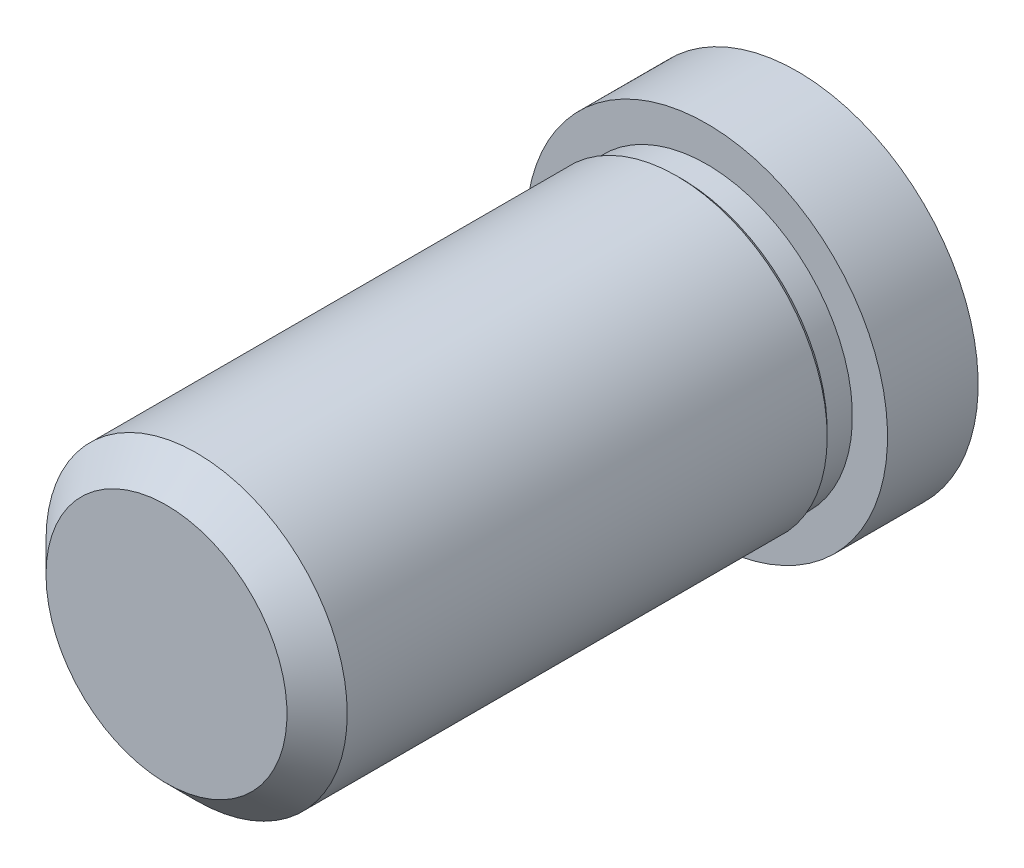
ISO-10303-21;
HEADER;
FILE_DESCRIPTION(('STEP AP214'),'2;1');
FILE_NAME('part.step','',(''),(''),'','','');
FILE_SCHEMA(('AUTOMOTIVE_DESIGN { 1 0 10303 214 1 1 1 1 }'));
ENDSEC;
DATA;
#1=APPLICATION_CONTEXT('core data for automotive mechanical design processes');
#2=APPLICATION_PROTOCOL_DEFINITION('international standard','automotive_design',2000,#1);
#3=PRODUCT_CONTEXT('',#1,'mechanical');
#4=PRODUCT('Part','Part','',(#3));
#5=PRODUCT_RELATED_PRODUCT_CATEGORY('part','',(#4));
#6=PRODUCT_DEFINITION_FORMATION('','',#4);
#7=PRODUCT_DEFINITION_CONTEXT('part definition',#1,'design');
#8=PRODUCT_DEFINITION('design','',#6,#7);
#9=PRODUCT_DEFINITION_SHAPE('','',#8);
#10=(LENGTH_UNIT() NAMED_UNIT(*) SI_UNIT(.MILLI.,.METRE.));
#11=(NAMED_UNIT(*) PLANE_ANGLE_UNIT() SI_UNIT($,.RADIAN.));
#12=(NAMED_UNIT(*) SI_UNIT($,.STERADIAN.) SOLID_ANGLE_UNIT());
#13=UNCERTAINTY_MEASURE_WITH_UNIT(LENGTH_MEASURE(1.E-05),#10,'distance_accuracy_value','');
#14=(GEOMETRIC_REPRESENTATION_CONTEXT(3) GLOBAL_UNCERTAINTY_ASSIGNED_CONTEXT((#13)) GLOBAL_UNIT_ASSIGNED_CONTEXT((#10,
#11,#12)) REPRESENTATION_CONTEXT('',''));
#15=CARTESIAN_POINT('',(0.,0.,0.));
#16=DIRECTION('',(0.,0.,1.));
#17=DIRECTION('',(1.,0.,0.));
#18=AXIS2_PLACEMENT_3D('',#15,#16,#17);
#19=CARTESIAN_POINT('',(-9.52500000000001,0.,-4.7752));
#20=DIRECTION('',(0.,0.,1.));
#21=DIRECTION('',(1.,0.,0.));
#22=AXIS2_PLACEMENT_3D('',#19,#20,#21);
#23=PLANE('',#22);
#24=CARTESIAN_POINT('',(0.,0.,-4.7752));
#25=DIRECTION('',(0.,0.,-1.));
#26=DIRECTION('',(-1.,0.,0.));
#27=AXIS2_PLACEMENT_3D('',#24,#25,#26);
#28=CIRCLE('',#27,9.525);
#29=CARTESIAN_POINT('',(-9.525,0.,-4.7752));
#30=VERTEX_POINT('',#29);
#31=EDGE_CURVE('E78',#30,#30,#28,.T.);
#32=ORIENTED_EDGE('',*,*,#31,.T.);
#33=EDGE_LOOP('',(#32));
#34=FACE_BOUND('',#33,.T.);
#35=ADVANCED_FACE('F43',(#34),#23,.F.);
#36=CARTESIAN_POINT('',(-5.07999999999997,0.,28.47467));
#37=DIRECTION('',(0.,0.,-1.));
#38=DIRECTION('',(-1.,0.,0.));
#39=AXIS2_PLACEMENT_3D('',#36,#37,#38);
#40=PLANE('',#39);
#41=CARTESIAN_POINT('',(0.,0.,28.47467));
#42=DIRECTION('',(0.,0.,-1.));
#43=DIRECTION('',(-1.,0.,0.));
#44=AXIS2_PLACEMENT_3D('',#41,#42,#43);
#45=CIRCLE('',#44,6.34999999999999);
#46=CARTESIAN_POINT('',(-6.34999999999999,0.,28.47467));
#47=VERTEX_POINT('',#46);
#48=EDGE_CURVE('E10',#47,#47,#45,.F.);
#49=ORIENTED_EDGE('',*,*,#48,.T.);
#50=EDGE_LOOP('',(#49));
#51=FACE_BOUND('',#50,.T.);
#52=ADVANCED_FACE('F111',(#51),#40,.F.);
#53=CARTESIAN_POINT('',(0.,0.,-19.4322936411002));
#54=DIRECTION('',(0.,0.,-1.));
#55=DIRECTION('',(-1.,0.,0.));
#56=AXIS2_PLACEMENT_3D('',#53,#54,#55);
#57=CYLINDRICAL_SURFACE('',#56,7.9375);
#58=CARTESIAN_POINT('',(0.,0.,26.88717));
#59=DIRECTION('',(0.,0.,-1.));
#60=DIRECTION('',(-1.,0.,0.));
#61=AXIS2_PLACEMENT_3D('',#58,#59,#60);
#62=CIRCLE('',#61,7.9375);
#63=CARTESIAN_POINT('',(-7.9375,0.,26.88717));
#64=VERTEX_POINT('',#63);
#65=EDGE_CURVE('E52',#64,#64,#62,.T.);
#66=ORIENTED_EDGE('',*,*,#65,.T.);
#67=EDGE_LOOP('',(#66));
#68=FACE_BOUND('',#67,.T.);
#69=CARTESIAN_POINT('',(0.,0.,1.59173333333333));
#70=DIRECTION('',(0.,0.,-1.));
#71=DIRECTION('',(-1.,0.,0.));
#72=AXIS2_PLACEMENT_3D('',#69,#70,#71);
#73=CIRCLE('',#72,7.9375);
#74=CARTESIAN_POINT('',(-7.9375,0.,1.59173333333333));
#75=VERTEX_POINT('',#74);
#76=EDGE_CURVE('E58',#75,#75,#73,.T.);
#77=ORIENTED_EDGE('',*,*,#76,.F.);
#78=EDGE_LOOP('',(#77));
#79=FACE_BOUND('',#78,.T.);
#80=ADVANCED_FACE('F106',(#68,#79),#57,.T.);
#81=CARTESIAN_POINT('',(0.,0.,1.59173333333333));
#82=DIRECTION('',(0.,0.,1.));
#83=DIRECTION('',(1.,0.,0.));
#84=AXIS2_PLACEMENT_3D('',#81,#82,#83);
#85=CONICAL_SURFACE('',#84,7.9375,0.785398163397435);
#86=CARTESIAN_POINT('',(0.,0.,1.32715));
#87=DIRECTION('',(0.,0.,-1.));
#88=DIRECTION('',(-1.,0.,0.));
#89=AXIS2_PLACEMENT_3D('',#86,#87,#88);
#90=CIRCLE('',#89,7.67291666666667);
#91=CARTESIAN_POINT('',(-7.67291666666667,0.,1.32715));
#92=VERTEX_POINT('',#91);
#93=EDGE_CURVE('E64',#92,#92,#90,.T.);
#94=ORIENTED_EDGE('',*,*,#93,.F.);
#95=EDGE_LOOP('',(#94));
#96=FACE_BOUND('',#95,.T.);
#97=ORIENTED_EDGE('',*,*,#76,.T.);
#98=EDGE_LOOP('',(#97));
#99=FACE_BOUND('',#98,.T.);
#100=ADVANCED_FACE('F100',(#96,#99),#85,.T.);
#101=CARTESIAN_POINT('',(0.,0.,-19.4322936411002));
#102=DIRECTION('',(0.,0.,-1.));
#103=DIRECTION('',(-1.,0.,0.));
#104=AXIS2_PLACEMENT_3D('',#101,#102,#103);
#105=CYLINDRICAL_SURFACE('',#104,7.67291666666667);
#106=CARTESIAN_POINT('',(0.,0.,0.));
#107=DIRECTION('',(0.,0.,-1.));
#108=DIRECTION('',(-1.,0.,0.));
#109=AXIS2_PLACEMENT_3D('',#106,#107,#108);
#110=CIRCLE('',#109,7.67291666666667);
#111=CARTESIAN_POINT('',(-7.67291666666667,0.,0.));
#112=VERTEX_POINT('',#111);
#113=EDGE_CURVE('E70',#112,#112,#110,.T.);
#114=ORIENTED_EDGE('',*,*,#113,.F.);
#115=EDGE_LOOP('',(#114));
#116=FACE_BOUND('',#115,.T.);
#117=ORIENTED_EDGE('',*,*,#93,.T.);
#118=EDGE_LOOP('',(#117));
#119=FACE_BOUND('',#118,.T.);
#120=ADVANCED_FACE('F94',(#116,#119),#105,.T.);
#121=CARTESIAN_POINT('',(-7.6729166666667,0.,0.));
#122=DIRECTION('',(0.,0.,-1.));
#123=DIRECTION('',(-1.,0.,0.));
#124=AXIS2_PLACEMENT_3D('',#121,#122,#123);
#125=PLANE('',#124);
#126=CARTESIAN_POINT('',(0.,0.,0.));
#127=DIRECTION('',(0.,0.,-1.));
#128=DIRECTION('',(-1.,0.,0.));
#129=AXIS2_PLACEMENT_3D('',#126,#127,#128);
#130=CIRCLE('',#129,9.525);
#131=CARTESIAN_POINT('',(-9.525,0.,0.));
#132=VERTEX_POINT('',#131);
#133=EDGE_CURVE('E74',#132,#132,#130,.T.);
#134=ORIENTED_EDGE('',*,*,#133,.F.);
#135=EDGE_LOOP('',(#134));
#136=FACE_BOUND('',#135,.T.);
#137=ORIENTED_EDGE('',*,*,#113,.T.);
#138=EDGE_LOOP('',(#137));
#139=FACE_BOUND('',#138,.T.);
#140=ADVANCED_FACE('F88',(#136,#139),#125,.F.);
#141=CARTESIAN_POINT('',(0.,0.,-19.4322936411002));
#142=DIRECTION('',(0.,0.,-1.));
#143=DIRECTION('',(-1.,0.,0.));
#144=AXIS2_PLACEMENT_3D('',#141,#142,#143);
#145=CYLINDRICAL_SURFACE('',#144,9.525);
#146=ORIENTED_EDGE('',*,*,#31,.F.);
#147=EDGE_LOOP('',(#146));
#148=FACE_BOUND('',#147,.T.);
#149=ORIENTED_EDGE('',*,*,#133,.T.);
#150=EDGE_LOOP('',(#149));
#151=FACE_BOUND('',#150,.T.);
#152=ADVANCED_FACE('F85',(#148,#151),#145,.T.);
#153=CARTESIAN_POINT('',(0.,0.,26.88717));
#154=DIRECTION('',(0.,0.,-1.));
#155=DIRECTION('',(-1.,0.,0.));
#156=AXIS2_PLACEMENT_3D('',#153,#154,#155);
#157=CONICAL_SURFACE('',#156,7.9375,0.785398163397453);
#158=ORIENTED_EDGE('',*,*,#48,.F.);
#159=EDGE_LOOP('',(#158));
#160=FACE_BOUND('',#159,.T.);
#161=ORIENTED_EDGE('',*,*,#65,.F.);
#162=EDGE_LOOP('',(#161));
#163=FACE_BOUND('',#162,.T.);
#164=ADVANCED_FACE('F46',(#160,#163),#157,.T.);
#165=CLOSED_SHELL('',(#35,#52,#80,#100,#120,#140,#152,#164));
#166=MANIFOLD_SOLID_BREP('B2',#165);
#167=ADVANCED_BREP_SHAPE_REPRESENTATION('',(#18,#166),#14);
#168=SHAPE_DEFINITION_REPRESENTATION(#9,#167);
ENDSEC;
END-ISO-10303-21;
